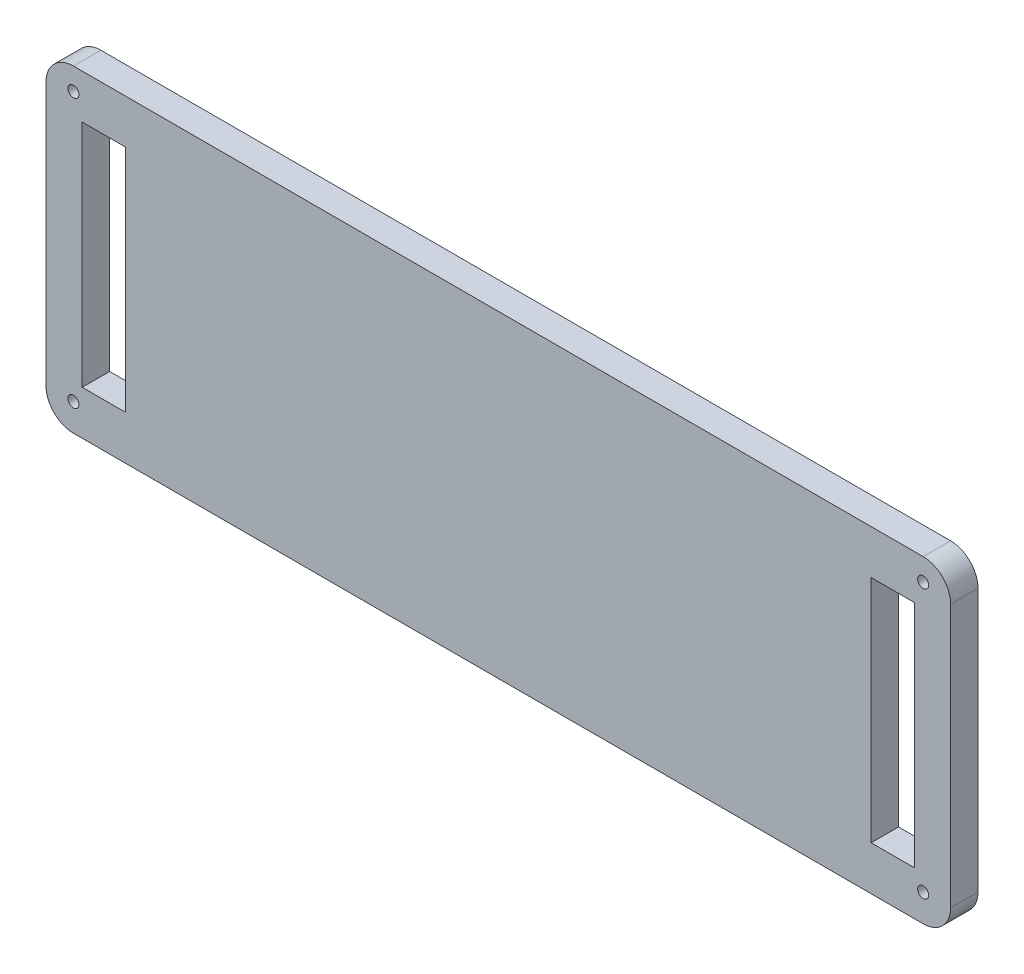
ISO-10303-21;
HEADER;
FILE_DESCRIPTION(('STEP AP214'),'2;1');
FILE_NAME('part.step','',(''),(''),'','','');
FILE_SCHEMA(('AUTOMOTIVE_DESIGN { 1 0 10303 214 1 1 1 1 }'));
ENDSEC;
DATA;
#1=APPLICATION_CONTEXT('core data for automotive mechanical design processes');
#2=APPLICATION_PROTOCOL_DEFINITION('international standard','automotive_design',2000,#1);
#3=PRODUCT_CONTEXT('',#1,'mechanical');
#4=PRODUCT('Part','Part','',(#3));
#5=PRODUCT_RELATED_PRODUCT_CATEGORY('part','',(#4));
#6=PRODUCT_DEFINITION_FORMATION('','',#4);
#7=PRODUCT_DEFINITION_CONTEXT('part definition',#1,'design');
#8=PRODUCT_DEFINITION('design','',#6,#7);
#9=PRODUCT_DEFINITION_SHAPE('','',#8);
#10=(LENGTH_UNIT() NAMED_UNIT(*) SI_UNIT(.MILLI.,.METRE.));
#11=(NAMED_UNIT(*) PLANE_ANGLE_UNIT() SI_UNIT($,.RADIAN.));
#12=(NAMED_UNIT(*) SI_UNIT($,.STERADIAN.) SOLID_ANGLE_UNIT());
#13=UNCERTAINTY_MEASURE_WITH_UNIT(LENGTH_MEASURE(1.E-05),#10,'distance_accuracy_value','');
#14=(GEOMETRIC_REPRESENTATION_CONTEXT(3) GLOBAL_UNCERTAINTY_ASSIGNED_CONTEXT((#13)) GLOBAL_UNIT_ASSIGNED_CONTEXT((#10,
#11,#12)) REPRESENTATION_CONTEXT('',''));
#15=CARTESIAN_POINT('',(0.,0.,0.));
#16=DIRECTION('',(0.,0.,1.));
#17=DIRECTION('',(1.,0.,0.));
#18=AXIS2_PLACEMENT_3D('',#15,#16,#17);
#19=CARTESIAN_POINT('',(107.488593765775,-74.7439939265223,51.7236075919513));
#20=DIRECTION('',(-1.,0.,0.));
#21=DIRECTION('',(0.,0.,1.));
#22=AXIS2_PLACEMENT_3D('',#19,#20,#21);
#23=PLANE('',#22);
#24=DIRECTION('',(0.,1.,0.));
#25=VECTOR('',#24,1.);
#26=CARTESIAN_POINT('',(107.488593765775,-74.7439939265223,41.7236075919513));
#27=LINE('',#26,#25);
#28=CARTESIAN_POINT('',(107.488593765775,-64.7439939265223,41.7236075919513));
#29=VERTEX_POINT('',#28);
#30=CARTESIAN_POINT('',(107.488593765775,31.2560060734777,41.7236075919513));
#31=VERTEX_POINT('',#30);
#32=EDGE_CURVE('E270',#29,#31,#27,.T.);
#33=ORIENTED_EDGE('',*,*,#32,.T.);
#34=DIRECTION('',(0.,0.,-1.));
#35=VECTOR('',#34,1.);
#36=CARTESIAN_POINT('',(107.488593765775,31.2560060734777,51.7236075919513));
#37=LINE('',#36,#35);
#38=CARTESIAN_POINT('',(107.488593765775,31.2560060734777,51.7236075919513));
#39=VERTEX_POINT('',#38);
#40=EDGE_CURVE('E328',#31,#39,#37,.F.);
#41=ORIENTED_EDGE('',*,*,#40,.T.);
#42=DIRECTION('',(0.,1.,0.));
#43=VECTOR('',#42,1.);
#44=CARTESIAN_POINT('',(107.488593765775,-74.7439939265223,51.7236075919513));
#45=LINE('',#44,#43);
#46=CARTESIAN_POINT('',(107.488593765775,-64.7439939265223,51.7236075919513));
#47=VERTEX_POINT('',#46);
#48=EDGE_CURVE('E274',#47,#39,#45,.T.);
#49=ORIENTED_EDGE('',*,*,#48,.F.);
#50=DIRECTION('',(0.,0.,-1.));
#51=VECTOR('',#50,1.);
#52=CARTESIAN_POINT('',(107.488593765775,-64.7439939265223,51.7236075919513));
#53=LINE('',#52,#51);
#54=EDGE_CURVE('E324',#47,#29,#53,.T.);
#55=ORIENTED_EDGE('',*,*,#54,.T.);
#56=EDGE_LOOP('',(#33,#41,#49,#55));
#57=FACE_BOUND('',#56,.T.);
#58=ADVANCED_FACE('F39',(#57),#23,.F.);
#59=CARTESIAN_POINT('',(-222.511406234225,41.2560060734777,51.7236075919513));
#60=DIRECTION('',(0.,-1.,0.));
#61=DIRECTION('',(0.,0.,-1.));
#62=AXIS2_PLACEMENT_3D('',#59,#60,#61);
#63=PLANE('',#62);
#64=DIRECTION('',(-1.,0.,0.));
#65=VECTOR('',#64,1.);
#66=CARTESIAN_POINT('',(-222.511406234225,41.2560060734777,51.7236075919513));
#67=LINE('',#66,#65);
#68=CARTESIAN_POINT('',(97.4885937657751,41.2560060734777,51.7236075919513));
#69=VERTEX_POINT('',#68);
#70=CARTESIAN_POINT('',(-212.511406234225,41.2560060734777,51.7236075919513));
#71=VERTEX_POINT('',#70);
#72=EDGE_CURVE('E278',#69,#71,#67,.T.);
#73=ORIENTED_EDGE('',*,*,#72,.F.);
#74=DIRECTION('',(0.,0.,-1.));
#75=VECTOR('',#74,1.);
#76=CARTESIAN_POINT('',(97.4885937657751,41.2560060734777,51.7236075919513));
#77=LINE('',#76,#75);
#78=CARTESIAN_POINT('',(97.4885937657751,41.2560060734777,41.7236075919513));
#79=VERTEX_POINT('',#78);
#80=EDGE_CURVE('E308',#69,#79,#77,.T.);
#81=ORIENTED_EDGE('',*,*,#80,.T.);
#82=DIRECTION('',(-1.,0.,0.));
#83=VECTOR('',#82,1.);
#84=CARTESIAN_POINT('',(-222.511406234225,41.2560060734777,41.7236075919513));
#85=LINE('',#84,#83);
#86=CARTESIAN_POINT('',(-212.511406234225,41.2560060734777,41.7236075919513));
#87=VERTEX_POINT('',#86);
#88=EDGE_CURVE('E295',#79,#87,#85,.T.);
#89=ORIENTED_EDGE('',*,*,#88,.T.);
#90=DIRECTION('',(0.,0.,-1.));
#91=VECTOR('',#90,1.);
#92=CARTESIAN_POINT('',(-212.511406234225,41.2560060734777,51.7236075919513));
#93=LINE('',#92,#91);
#94=EDGE_CURVE('E291',#87,#71,#93,.F.);
#95=ORIENTED_EDGE('',*,*,#94,.T.);
#96=EDGE_LOOP('',(#73,#81,#89,#95));
#97=FACE_BOUND('',#96,.T.);
#98=ADVANCED_FACE('F386',(#97),#63,.F.);
#99=CARTESIAN_POINT('',(-222.511406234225,-74.7439939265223,51.7236075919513));
#100=DIRECTION('',(1.,0.,0.));
#101=DIRECTION('',(0.,0.,-1.));
#102=AXIS2_PLACEMENT_3D('',#99,#100,#101);
#103=PLANE('',#102);
#104=DIRECTION('',(0.,-1.,0.));
#105=VECTOR('',#104,1.);
#106=CARTESIAN_POINT('',(-222.511406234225,-74.7439939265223,41.7236075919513));
#107=LINE('',#106,#105);
#108=CARTESIAN_POINT('',(-222.511406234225,31.2560060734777,41.7236075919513));
#109=VERTEX_POINT('',#108);
#110=CARTESIAN_POINT('',(-222.511406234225,-64.7439939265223,41.7236075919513));
#111=VERTEX_POINT('',#110);
#112=EDGE_CURVE('E299',#109,#111,#107,.T.);
#113=ORIENTED_EDGE('',*,*,#112,.T.);
#114=DIRECTION('',(0.,0.,-1.));
#115=VECTOR('',#114,1.);
#116=CARTESIAN_POINT('',(-222.511406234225,-64.7439939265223,51.7236075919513));
#117=LINE('',#116,#115);
#118=CARTESIAN_POINT('',(-222.511406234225,-64.7439939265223,51.7236075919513));
#119=VERTEX_POINT('',#118);
#120=EDGE_CURVE('E11',#111,#119,#117,.F.);
#121=ORIENTED_EDGE('',*,*,#120,.T.);
#122=DIRECTION('',(0.,-1.,0.));
#123=VECTOR('',#122,1.);
#124=CARTESIAN_POINT('',(-222.511406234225,-74.7439939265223,51.7236075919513));
#125=LINE('',#124,#123);
#126=CARTESIAN_POINT('',(-222.511406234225,31.2560060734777,51.7236075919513));
#127=VERTEX_POINT('',#126);
#128=EDGE_CURVE('E283',#127,#119,#125,.T.);
#129=ORIENTED_EDGE('',*,*,#128,.F.);
#130=DIRECTION('',(0.,0.,-1.));
#131=VECTOR('',#130,1.);
#132=CARTESIAN_POINT('',(-222.511406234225,31.2560060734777,51.7236075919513));
#133=LINE('',#132,#131);
#134=EDGE_CURVE('E48',#127,#109,#133,.T.);
#135=ORIENTED_EDGE('',*,*,#134,.T.);
#136=EDGE_LOOP('',(#113,#121,#129,#135));
#137=FACE_BOUND('',#136,.T.);
#138=ADVANCED_FACE('F355',(#137),#103,.F.);
#139=CARTESIAN_POINT('',(-222.511406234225,-74.7439939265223,51.7236075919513));
#140=DIRECTION('',(0.,1.,0.));
#141=DIRECTION('',(0.,0.,1.));
#142=AXIS2_PLACEMENT_3D('',#139,#140,#141);
#143=PLANE('',#142);
#144=DIRECTION('',(1.,0.,0.));
#145=VECTOR('',#144,1.);
#146=CARTESIAN_POINT('',(-222.511406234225,-74.7439939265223,41.7236075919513));
#147=LINE('',#146,#145);
#148=CARTESIAN_POINT('',(-212.511406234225,-74.7439939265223,41.7236075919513));
#149=VERTEX_POINT('',#148);
#150=CARTESIAN_POINT('',(97.4885937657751,-74.7439939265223,41.7236075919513));
#151=VERTEX_POINT('',#150);
#152=EDGE_CURVE('E279',#149,#151,#147,.T.);
#153=ORIENTED_EDGE('',*,*,#152,.T.);
#154=DIRECTION('',(0.,0.,-1.));
#155=VECTOR('',#154,1.);
#156=CARTESIAN_POINT('',(97.4885937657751,-74.7439939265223,51.7236075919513));
#157=LINE('',#156,#155);
#158=CARTESIAN_POINT('',(97.4885937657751,-74.7439939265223,51.7236075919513));
#159=VERTEX_POINT('',#158);
#160=EDGE_CURVE('E347',#151,#159,#157,.F.);
#161=ORIENTED_EDGE('',*,*,#160,.T.);
#162=DIRECTION('',(1.,0.,0.));
#163=VECTOR('',#162,1.);
#164=CARTESIAN_POINT('',(-222.511406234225,-74.7439939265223,51.7236075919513));
#165=LINE('',#164,#163);
#166=CARTESIAN_POINT('',(-212.511406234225,-74.7439939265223,51.7236075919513));
#167=VERTEX_POINT('',#166);
#168=EDGE_CURVE('E287',#167,#159,#165,.T.);
#169=ORIENTED_EDGE('',*,*,#168,.F.);
#170=DIRECTION('',(0.,0.,-1.));
#171=VECTOR('',#170,1.);
#172=CARTESIAN_POINT('',(-212.511406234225,-74.7439939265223,51.7236075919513));
#173=LINE('',#172,#171);
#174=EDGE_CURVE('E343',#167,#149,#173,.T.);
#175=ORIENTED_EDGE('',*,*,#174,.T.);
#176=EDGE_LOOP('',(#153,#161,#169,#175));
#177=FACE_BOUND('',#176,.T.);
#178=ADVANCED_FACE('F368',(#177),#143,.F.);
#179=CARTESIAN_POINT('',(-57.511406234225,-16.7439939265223,51.7236075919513));
#180=DIRECTION('',(0.,0.,-1.));
#181=DIRECTION('',(-1.,0.,0.));
#182=AXIS2_PLACEMENT_3D('',#179,#180,#181);
#183=PLANE('',#182);
#184=DIRECTION('',(-1.,0.,0.));
#185=VECTOR('',#184,1.);
#186=CARTESIAN_POINT('',(94.2885937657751,25.1560060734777,51.7236075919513));
#187=LINE('',#186,#185);
#188=CARTESIAN_POINT('',(94.2885937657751,25.1560060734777,51.7236075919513));
#189=VERTEX_POINT('',#188);
#190=CARTESIAN_POINT('',(78.4885937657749,25.1560060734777,51.7236075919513));
#191=VERTEX_POINT('',#190);
#192=EDGE_CURVE('E184',#189,#191,#187,.T.);
#193=ORIENTED_EDGE('',*,*,#192,.F.);
#194=DIRECTION('',(0.,1.,0.));
#195=VECTOR('',#194,1.);
#196=CARTESIAN_POINT('',(94.2885937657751,-58.6439939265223,51.7236075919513));
#197=LINE('',#196,#195);
#198=CARTESIAN_POINT('',(94.2885937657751,-58.6439939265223,51.7236075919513));
#199=VERTEX_POINT('',#198);
#200=EDGE_CURVE('E55',#199,#189,#197,.T.);
#201=ORIENTED_EDGE('',*,*,#200,.F.);
#202=DIRECTION('',(-1.,0.,0.));
#203=VECTOR('',#202,1.);
#204=CARTESIAN_POINT('',(94.2885937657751,-58.6439939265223,51.7236075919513));
#205=LINE('',#204,#203);
#206=CARTESIAN_POINT('',(78.4885937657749,-58.6439939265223,51.7236075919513));
#207=VERTEX_POINT('',#206);
#208=EDGE_CURVE('E171',#199,#207,#205,.T.);
#209=ORIENTED_EDGE('',*,*,#208,.T.);
#210=DIRECTION('',(0.,1.,0.));
#211=VECTOR('',#210,1.);
#212=CARTESIAN_POINT('',(78.4885937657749,-58.6439939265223,51.7236075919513));
#213=LINE('',#212,#211);
#214=EDGE_CURVE('E175',#207,#191,#213,.T.);
#215=ORIENTED_EDGE('',*,*,#214,.T.);
#216=EDGE_LOOP('',(#193,#201,#209,#215));
#217=FACE_BOUND('',#216,.T.);
#218=DIRECTION('',(0.,1.,0.));
#219=VECTOR('',#218,1.);
#220=CARTESIAN_POINT('',(-193.511406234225,-58.6439939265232,51.7236075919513));
#221=LINE('',#220,#219);
#222=CARTESIAN_POINT('',(-193.511406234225,-58.6439939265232,51.7236075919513));
#223=VERTEX_POINT('',#222);
#224=CARTESIAN_POINT('',(-193.511406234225,25.1560060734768,51.7236075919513));
#225=VERTEX_POINT('',#224);
#226=EDGE_CURVE('E218',#223,#225,#221,.T.);
#227=ORIENTED_EDGE('',*,*,#226,.F.);
#228=DIRECTION('',(1.,0.,0.));
#229=VECTOR('',#228,1.);
#230=CARTESIAN_POINT('',(-209.311406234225,-58.6439939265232,51.7236075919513));
#231=LINE('',#230,#229);
#232=CARTESIAN_POINT('',(-209.311406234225,-58.6439939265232,51.7236075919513));
#233=VERTEX_POINT('',#232);
#234=EDGE_CURVE('E193',#233,#223,#231,.T.);
#235=ORIENTED_EDGE('',*,*,#234,.F.);
#236=DIRECTION('',(0.,1.,0.));
#237=VECTOR('',#236,1.);
#238=CARTESIAN_POINT('',(-209.311406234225,-58.6439939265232,51.7236075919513));
#239=LINE('',#238,#237);
#240=CARTESIAN_POINT('',(-209.311406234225,25.1560060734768,51.7236075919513));
#241=VERTEX_POINT('',#240);
#242=EDGE_CURVE('E204',#233,#241,#239,.T.);
#243=ORIENTED_EDGE('',*,*,#242,.T.);
#244=DIRECTION('',(1.,0.,0.));
#245=VECTOR('',#244,1.);
#246=CARTESIAN_POINT('',(-209.311406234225,25.1560060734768,51.7236075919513));
#247=LINE('',#246,#245);
#248=EDGE_CURVE('E222',#241,#225,#247,.T.);
#249=ORIENTED_EDGE('',*,*,#248,.T.);
#250=EDGE_LOOP('',(#227,#235,#243,#249));
#251=FACE_BOUND('',#250,.T.);
#252=CARTESIAN_POINT('',(-212.511406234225,33.2060060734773,51.7236075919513));
#253=DIRECTION('',(0.,0.,1.));
#254=DIRECTION('',(1.,0.,0.));
#255=AXIS2_PLACEMENT_3D('',#252,#253,#254);
#256=CIRCLE('',#255,2.00102409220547);
#257=CARTESIAN_POINT('',(-210.510382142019,33.2060060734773,51.7236075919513));
#258=VERTEX_POINT('',#257);
#259=EDGE_CURVE('E255',#258,#258,#256,.T.);
#260=ORIENTED_EDGE('',*,*,#259,.F.);
#261=EDGE_LOOP('',(#260));
#262=FACE_BOUND('',#261,.T.);
#263=CARTESIAN_POINT('',(97.4885937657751,-64.7439939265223,51.7236075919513));
#264=DIRECTION('',(0.,0.,1.));
#265=DIRECTION('',(1.,0.,0.));
#266=AXIS2_PLACEMENT_3D('',#263,#264,#265);
#267=CIRCLE('',#266,2.);
#268=CARTESIAN_POINT('',(99.4885937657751,-64.7439939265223,51.7236075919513));
#269=VERTEX_POINT('',#268);
#270=EDGE_CURVE('E246',#269,#269,#267,.T.);
#271=ORIENTED_EDGE('',*,*,#270,.F.);
#272=EDGE_LOOP('',(#271));
#273=FACE_BOUND('',#272,.T.);
#274=CARTESIAN_POINT('',(97.4885937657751,33.2060060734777,51.7236075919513));
#275=DIRECTION('',(0.,0.,1.));
#276=DIRECTION('',(1.,0.,0.));
#277=AXIS2_PLACEMENT_3D('',#274,#275,#276);
#278=CIRCLE('',#277,2.);
#279=CARTESIAN_POINT('',(99.4885937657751,33.2060060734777,51.7236075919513));
#280=VERTEX_POINT('',#279);
#281=EDGE_CURVE('E232',#280,#280,#278,.T.);
#282=ORIENTED_EDGE('',*,*,#281,.F.);
#283=EDGE_LOOP('',(#282));
#284=FACE_BOUND('',#283,.T.);
#285=CARTESIAN_POINT('',(-212.511406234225,-64.7439939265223,51.7236075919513));
#286=DIRECTION('',(0.,0.,1.));
#287=DIRECTION('',(1.,0.,0.));
#288=AXIS2_PLACEMENT_3D('',#285,#286,#287);
#289=CIRCLE('',#288,2.);
#290=CARTESIAN_POINT('',(-210.511406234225,-64.7439939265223,51.7236075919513));
#291=VERTEX_POINT('',#290);
#292=EDGE_CURVE('E254',#291,#291,#289,.T.);
#293=ORIENTED_EDGE('',*,*,#292,.F.);
#294=EDGE_LOOP('',(#293));
#295=FACE_BOUND('',#294,.T.);
#296=ORIENTED_EDGE('',*,*,#48,.T.);
#297=CARTESIAN_POINT('',(97.4885937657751,31.2560060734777,51.7236075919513));
#298=DIRECTION('',(0.,0.,-1.));
#299=DIRECTION('',(-1.,0.,0.));
#300=AXIS2_PLACEMENT_3D('',#297,#298,#299);
#301=CIRCLE('',#300,10.);
#302=EDGE_CURVE('E340',#39,#69,#301,.F.);
#303=ORIENTED_EDGE('',*,*,#302,.T.);
#304=ORIENTED_EDGE('',*,*,#72,.T.);
#305=CARTESIAN_POINT('',(-212.511406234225,31.2560060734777,51.7236075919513));
#306=DIRECTION('',(0.,0.,-1.));
#307=DIRECTION('',(-1.,0.,0.));
#308=AXIS2_PLACEMENT_3D('',#305,#306,#307);
#309=CIRCLE('',#308,10.);
#310=EDGE_CURVE('E331',#71,#127,#309,.F.);
#311=ORIENTED_EDGE('',*,*,#310,.T.);
#312=ORIENTED_EDGE('',*,*,#128,.T.);
#313=CARTESIAN_POINT('',(-212.511406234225,-64.7439939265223,51.7236075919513));
#314=DIRECTION('',(0.,0.,-1.));
#315=DIRECTION('',(-1.,0.,0.));
#316=AXIS2_PLACEMENT_3D('',#313,#314,#315);
#317=CIRCLE('',#316,10.);
#318=EDGE_CURVE('E334',#119,#167,#317,.F.);
#319=ORIENTED_EDGE('',*,*,#318,.T.);
#320=ORIENTED_EDGE('',*,*,#168,.T.);
#321=CARTESIAN_POINT('',(97.4885937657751,-64.7439939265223,51.7236075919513));
#322=DIRECTION('',(0.,0.,-1.));
#323=DIRECTION('',(-1.,0.,0.));
#324=AXIS2_PLACEMENT_3D('',#321,#322,#323);
#325=CIRCLE('',#324,10.);
#326=EDGE_CURVE('E337',#159,#47,#325,.F.);
#327=ORIENTED_EDGE('',*,*,#326,.T.);
#328=EDGE_LOOP('',(#296,#303,#304,#311,#312,#319,#320,#327));
#329=FACE_BOUND('',#328,.T.);
#330=ADVANCED_FACE('F372',(#217,#251,#262,#273,#284,#295,#329),#183,.F.);
#331=CARTESIAN_POINT('',(-57.511406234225,-16.7439939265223,41.7236075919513));
#332=DIRECTION('',(0.,0.,-1.));
#333=DIRECTION('',(-1.,0.,0.));
#334=AXIS2_PLACEMENT_3D('',#331,#332,#333);
#335=PLANE('',#334);
#336=DIRECTION('',(0.,1.,0.));
#337=VECTOR('',#336,1.);
#338=CARTESIAN_POINT('',(94.2885937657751,-58.6439939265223,41.7236075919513));
#339=LINE('',#338,#337);
#340=CARTESIAN_POINT('',(94.2885937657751,-58.6439939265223,41.7236075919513));
#341=VERTEX_POINT('',#340);
#342=CARTESIAN_POINT('',(94.2885937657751,25.1560060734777,41.7236075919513));
#343=VERTEX_POINT('',#342);
#344=EDGE_CURVE('E154',#341,#343,#339,.T.);
#345=ORIENTED_EDGE('',*,*,#344,.T.);
#346=DIRECTION('',(-1.,0.,0.));
#347=VECTOR('',#346,1.);
#348=CARTESIAN_POINT('',(94.2885937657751,25.1560060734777,41.7236075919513));
#349=LINE('',#348,#347);
#350=CARTESIAN_POINT('',(78.4885937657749,25.1560060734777,41.7236075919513));
#351=VERTEX_POINT('',#350);
#352=EDGE_CURVE('E161',#343,#351,#349,.T.);
#353=ORIENTED_EDGE('',*,*,#352,.T.);
#354=DIRECTION('',(0.,1.,0.));
#355=VECTOR('',#354,1.);
#356=CARTESIAN_POINT('',(78.4885937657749,-58.6439939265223,41.7236075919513));
#357=LINE('',#356,#355);
#358=CARTESIAN_POINT('',(78.4885937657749,-58.6439939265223,41.7236075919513));
#359=VERTEX_POINT('',#358);
#360=EDGE_CURVE('E166',#359,#351,#357,.T.);
#361=ORIENTED_EDGE('',*,*,#360,.F.);
#362=DIRECTION('',(-1.,0.,0.));
#363=VECTOR('',#362,1.);
#364=CARTESIAN_POINT('',(94.2885937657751,-58.6439939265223,41.7236075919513));
#365=LINE('',#364,#363);
#366=EDGE_CURVE('E158',#341,#359,#365,.T.);
#367=ORIENTED_EDGE('',*,*,#366,.F.);
#368=EDGE_LOOP('',(#345,#353,#361,#367));
#369=FACE_BOUND('',#368,.T.);
#370=DIRECTION('',(1.,0.,0.));
#371=VECTOR('',#370,1.);
#372=CARTESIAN_POINT('',(-209.311406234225,-58.6439939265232,41.7236075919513));
#373=LINE('',#372,#371);
#374=CARTESIAN_POINT('',(-209.311406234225,-58.6439939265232,41.7236075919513));
#375=VERTEX_POINT('',#374);
#376=CARTESIAN_POINT('',(-193.511406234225,-58.6439939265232,41.7236075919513));
#377=VERTEX_POINT('',#376);
#378=EDGE_CURVE('E199',#375,#377,#373,.T.);
#379=ORIENTED_EDGE('',*,*,#378,.T.);
#380=DIRECTION('',(0.,1.,0.));
#381=VECTOR('',#380,1.);
#382=CARTESIAN_POINT('',(-193.511406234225,-58.6439939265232,41.7236075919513));
#383=LINE('',#382,#381);
#384=CARTESIAN_POINT('',(-193.511406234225,25.1560060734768,41.7236075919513));
#385=VERTEX_POINT('',#384);
#386=EDGE_CURVE('E203',#377,#385,#383,.T.);
#387=ORIENTED_EDGE('',*,*,#386,.T.);
#388=DIRECTION('',(1.,0.,0.));
#389=VECTOR('',#388,1.);
#390=CARTESIAN_POINT('',(-209.311406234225,25.1560060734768,41.7236075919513));
#391=LINE('',#390,#389);
#392=CARTESIAN_POINT('',(-209.311406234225,25.1560060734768,41.7236075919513));
#393=VERTEX_POINT('',#392);
#394=EDGE_CURVE('E208',#393,#385,#391,.T.);
#395=ORIENTED_EDGE('',*,*,#394,.F.);
#396=DIRECTION('',(0.,1.,0.));
#397=VECTOR('',#396,1.);
#398=CARTESIAN_POINT('',(-209.311406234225,-58.6439939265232,41.7236075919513));
#399=LINE('',#398,#397);
#400=EDGE_CURVE('E212',#375,#393,#399,.T.);
#401=ORIENTED_EDGE('',*,*,#400,.F.);
#402=EDGE_LOOP('',(#379,#387,#395,#401));
#403=FACE_BOUND('',#402,.T.);
#404=CARTESIAN_POINT('',(-212.511406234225,33.2060060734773,41.7236075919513));
#405=DIRECTION('',(0.,0.,1.));
#406=DIRECTION('',(1.,0.,0.));
#407=AXIS2_PLACEMENT_3D('',#404,#405,#406);
#408=CIRCLE('',#407,2.00102409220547);
#409=CARTESIAN_POINT('',(-210.510382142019,33.2060060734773,41.7236075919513));
#410=VERTEX_POINT('',#409);
#411=EDGE_CURVE('E250',#410,#410,#408,.T.);
#412=ORIENTED_EDGE('',*,*,#411,.T.);
#413=EDGE_LOOP('',(#412));
#414=FACE_BOUND('',#413,.T.);
#415=CARTESIAN_POINT('',(97.4885937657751,-64.7439939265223,41.7236075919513));
#416=DIRECTION('',(0.,0.,1.));
#417=DIRECTION('',(1.,0.,0.));
#418=AXIS2_PLACEMENT_3D('',#415,#416,#417);
#419=CIRCLE('',#418,2.);
#420=CARTESIAN_POINT('',(99.4885937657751,-64.7439939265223,41.7236075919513));
#421=VERTEX_POINT('',#420);
#422=EDGE_CURVE('E259',#421,#421,#419,.T.);
#423=ORIENTED_EDGE('',*,*,#422,.T.);
#424=EDGE_LOOP('',(#423));
#425=FACE_BOUND('',#424,.T.);
#426=CARTESIAN_POINT('',(97.4885937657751,33.2060060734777,41.7236075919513));
#427=DIRECTION('',(0.,0.,1.));
#428=DIRECTION('',(1.,0.,0.));
#429=AXIS2_PLACEMENT_3D('',#426,#427,#428);
#430=CIRCLE('',#429,2.);
#431=CARTESIAN_POINT('',(99.4885937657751,33.2060060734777,41.7236075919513));
#432=VERTEX_POINT('',#431);
#433=EDGE_CURVE('E242',#432,#432,#430,.T.);
#434=ORIENTED_EDGE('',*,*,#433,.T.);
#435=EDGE_LOOP('',(#434));
#436=FACE_BOUND('',#435,.T.);
#437=CARTESIAN_POINT('',(-212.511406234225,-64.7439939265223,41.7236075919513));
#438=DIRECTION('',(0.,0.,1.));
#439=DIRECTION('',(1.,0.,0.));
#440=AXIS2_PLACEMENT_3D('',#437,#438,#439);
#441=CIRCLE('',#440,2.);
#442=CARTESIAN_POINT('',(-210.511406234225,-64.7439939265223,41.7236075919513));
#443=VERTEX_POINT('',#442);
#444=EDGE_CURVE('E266',#443,#443,#441,.T.);
#445=ORIENTED_EDGE('',*,*,#444,.T.);
#446=EDGE_LOOP('',(#445));
#447=FACE_BOUND('',#446,.T.);
#448=ORIENTED_EDGE('',*,*,#88,.F.);
#449=CARTESIAN_POINT('',(97.4885937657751,31.2560060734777,41.7236075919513));
#450=DIRECTION('',(0.,0.,-1.));
#451=DIRECTION('',(-1.,0.,0.));
#452=AXIS2_PLACEMENT_3D('',#449,#450,#451);
#453=CIRCLE('',#452,10.);
#454=EDGE_CURVE('E321',#79,#31,#453,.T.);
#455=ORIENTED_EDGE('',*,*,#454,.T.);
#456=ORIENTED_EDGE('',*,*,#32,.F.);
#457=CARTESIAN_POINT('',(97.4885937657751,-64.7439939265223,41.7236075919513));
#458=DIRECTION('',(0.,0.,-1.));
#459=DIRECTION('',(-1.,0.,0.));
#460=AXIS2_PLACEMENT_3D('',#457,#458,#459);
#461=CIRCLE('',#460,10.);
#462=EDGE_CURVE('E318',#29,#151,#461,.T.);
#463=ORIENTED_EDGE('',*,*,#462,.T.);
#464=ORIENTED_EDGE('',*,*,#152,.F.);
#465=CARTESIAN_POINT('',(-212.511406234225,-64.7439939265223,41.7236075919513));
#466=DIRECTION('',(0.,0.,-1.));
#467=DIRECTION('',(-1.,0.,0.));
#468=AXIS2_PLACEMENT_3D('',#465,#466,#467);
#469=CIRCLE('',#468,10.);
#470=EDGE_CURVE('E315',#149,#111,#469,.T.);
#471=ORIENTED_EDGE('',*,*,#470,.T.);
#472=ORIENTED_EDGE('',*,*,#112,.F.);
#473=CARTESIAN_POINT('',(-212.511406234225,31.2560060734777,41.7236075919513));
#474=DIRECTION('',(0.,0.,-1.));
#475=DIRECTION('',(-1.,0.,0.));
#476=AXIS2_PLACEMENT_3D('',#473,#474,#475);
#477=CIRCLE('',#476,10.);
#478=EDGE_CURVE('E312',#109,#87,#477,.T.);
#479=ORIENTED_EDGE('',*,*,#478,.T.);
#480=EDGE_LOOP('',(#448,#455,#456,#463,#464,#471,#472,#479));
#481=FACE_BOUND('',#480,.T.);
#482=ADVANCED_FACE('F168',(#369,#403,#414,#425,#436,#447,#481),#335,.T.);
#483=CARTESIAN_POINT('',(97.4885937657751,31.2560060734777,51.7236075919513));
#484=DIRECTION('',(0.,0.,-1.));
#485=DIRECTION('',(-1.,0.,0.));
#486=AXIS2_PLACEMENT_3D('',#483,#484,#485);
#487=CYLINDRICAL_SURFACE('',#486,10.);
#488=ORIENTED_EDGE('',*,*,#302,.F.);
#489=ORIENTED_EDGE('',*,*,#40,.F.);
#490=ORIENTED_EDGE('',*,*,#454,.F.);
#491=ORIENTED_EDGE('',*,*,#80,.F.);
#492=EDGE_LOOP('',(#488,#489,#490,#491));
#493=FACE_BOUND('',#492,.T.);
#494=ADVANCED_FACE('F383',(#493),#487,.T.);
#495=CARTESIAN_POINT('',(97.4885937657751,-64.7439939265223,51.7236075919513));
#496=DIRECTION('',(0.,0.,-1.));
#497=DIRECTION('',(-1.,0.,0.));
#498=AXIS2_PLACEMENT_3D('',#495,#496,#497);
#499=CYLINDRICAL_SURFACE('',#498,10.);
#500=ORIENTED_EDGE('',*,*,#326,.F.);
#501=ORIENTED_EDGE('',*,*,#160,.F.);
#502=ORIENTED_EDGE('',*,*,#462,.F.);
#503=ORIENTED_EDGE('',*,*,#54,.F.);
#504=EDGE_LOOP('',(#500,#501,#502,#503));
#505=FACE_BOUND('',#504,.T.);
#506=ADVANCED_FACE('F376',(#505),#499,.T.);
#507=CARTESIAN_POINT('',(-212.511406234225,-64.7439939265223,51.7236075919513));
#508=DIRECTION('',(0.,0.,-1.));
#509=DIRECTION('',(-1.,0.,0.));
#510=AXIS2_PLACEMENT_3D('',#507,#508,#509);
#511=CYLINDRICAL_SURFACE('',#510,10.);
#512=ORIENTED_EDGE('',*,*,#318,.F.);
#513=ORIENTED_EDGE('',*,*,#120,.F.);
#514=ORIENTED_EDGE('',*,*,#470,.F.);
#515=ORIENTED_EDGE('',*,*,#174,.F.);
#516=EDGE_LOOP('',(#512,#513,#514,#515));
#517=FACE_BOUND('',#516,.T.);
#518=ADVANCED_FACE('F365',(#517),#511,.T.);
#519=CARTESIAN_POINT('',(-212.511406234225,31.2560060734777,51.7236075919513));
#520=DIRECTION('',(0.,0.,-1.));
#521=DIRECTION('',(-1.,0.,0.));
#522=AXIS2_PLACEMENT_3D('',#519,#520,#521);
#523=CYLINDRICAL_SURFACE('',#522,10.);
#524=ORIENTED_EDGE('',*,*,#310,.F.);
#525=ORIENTED_EDGE('',*,*,#94,.F.);
#526=ORIENTED_EDGE('',*,*,#478,.F.);
#527=ORIENTED_EDGE('',*,*,#134,.F.);
#528=EDGE_LOOP('',(#524,#525,#526,#527));
#529=FACE_BOUND('',#528,.T.);
#530=ADVANCED_FACE('F41',(#529),#523,.T.);
#531=CARTESIAN_POINT('',(-212.511406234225,-64.7439939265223,41.7236075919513));
#532=DIRECTION('',(0.,0.,1.));
#533=DIRECTION('',(1.,0.,0.));
#534=AXIS2_PLACEMENT_3D('',#531,#532,#533);
#535=CYLINDRICAL_SURFACE('',#534,2.);
#536=ORIENTED_EDGE('',*,*,#444,.F.);
#537=EDGE_LOOP('',(#536));
#538=FACE_BOUND('',#537,.T.);
#539=ORIENTED_EDGE('',*,*,#292,.T.);
#540=EDGE_LOOP('',(#539));
#541=FACE_BOUND('',#540,.T.);
#542=ADVANCED_FACE('F389',(#538,#541),#535,.F.);
#543=CARTESIAN_POINT('',(97.4885937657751,33.2060060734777,41.7236075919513));
#544=DIRECTION('',(0.,0.,1.));
#545=DIRECTION('',(1.,0.,0.));
#546=AXIS2_PLACEMENT_3D('',#543,#544,#545);
#547=CYLINDRICAL_SURFACE('',#546,2.);
#548=ORIENTED_EDGE('',*,*,#433,.F.);
#549=EDGE_LOOP('',(#548));
#550=FACE_BOUND('',#549,.T.);
#551=ORIENTED_EDGE('',*,*,#281,.T.);
#552=EDGE_LOOP('',(#551));
#553=FACE_BOUND('',#552,.T.);
#554=ADVANCED_FACE('F394',(#550,#553),#547,.F.);
#555=CARTESIAN_POINT('',(97.4885937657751,-64.7439939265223,41.7236075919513));
#556=DIRECTION('',(0.,0.,1.));
#557=DIRECTION('',(1.,0.,0.));
#558=AXIS2_PLACEMENT_3D('',#555,#556,#557);
#559=CYLINDRICAL_SURFACE('',#558,2.);
#560=ORIENTED_EDGE('',*,*,#422,.F.);
#561=EDGE_LOOP('',(#560));
#562=FACE_BOUND('',#561,.T.);
#563=ORIENTED_EDGE('',*,*,#270,.T.);
#564=EDGE_LOOP('',(#563));
#565=FACE_BOUND('',#564,.T.);
#566=ADVANCED_FACE('F436',(#562,#565),#559,.F.);
#567=CARTESIAN_POINT('',(-212.511406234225,33.2060060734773,41.7236075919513));
#568=DIRECTION('',(0.,0.,1.));
#569=DIRECTION('',(1.,0.,0.));
#570=AXIS2_PLACEMENT_3D('',#567,#568,#569);
#571=CYLINDRICAL_SURFACE('',#570,2.00102409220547);
#572=ORIENTED_EDGE('',*,*,#411,.F.);
#573=EDGE_LOOP('',(#572));
#574=FACE_BOUND('',#573,.T.);
#575=ORIENTED_EDGE('',*,*,#259,.T.);
#576=EDGE_LOOP('',(#575));
#577=FACE_BOUND('',#576,.T.);
#578=ADVANCED_FACE('F446',(#574,#577),#571,.F.);
#579=CARTESIAN_POINT('',(-209.311406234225,-58.6439939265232,41.7236075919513));
#580=DIRECTION('',(0.,-1.,0.));
#581=DIRECTION('',(0.,0.,-1.));
#582=AXIS2_PLACEMENT_3D('',#579,#580,#581);
#583=PLANE('',#582);
#584=ORIENTED_EDGE('',*,*,#234,.T.);
#585=DIRECTION('',(0.,0.,1.));
#586=VECTOR('',#585,1.);
#587=CARTESIAN_POINT('',(-193.511406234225,-58.6439939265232,41.7236075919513));
#588=LINE('',#587,#586);
#589=EDGE_CURVE('E215',#377,#223,#588,.T.);
#590=ORIENTED_EDGE('',*,*,#589,.F.);
#591=ORIENTED_EDGE('',*,*,#378,.F.);
#592=DIRECTION('',(0.,0.,1.));
#593=VECTOR('',#592,1.);
#594=CARTESIAN_POINT('',(-209.311406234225,-58.6439939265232,41.7236075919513));
#595=LINE('',#594,#593);
#596=EDGE_CURVE('E229',#375,#233,#595,.T.);
#597=ORIENTED_EDGE('',*,*,#596,.T.);
#598=EDGE_LOOP('',(#584,#590,#591,#597));
#599=FACE_BOUND('',#598,.T.);
#600=ADVANCED_FACE('F456',(#599),#583,.F.);
#601=CARTESIAN_POINT('',(-209.311406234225,-58.6439939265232,41.7236075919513));
#602=DIRECTION('',(1.,0.,0.));
#603=DIRECTION('',(0.,0.,-1.));
#604=AXIS2_PLACEMENT_3D('',#601,#602,#603);
#605=PLANE('',#604);
#606=ORIENTED_EDGE('',*,*,#242,.F.);
#607=ORIENTED_EDGE('',*,*,#596,.F.);
#608=ORIENTED_EDGE('',*,*,#400,.T.);
#609=DIRECTION('',(0.,0.,1.));
#610=VECTOR('',#609,1.);
#611=CARTESIAN_POINT('',(-209.311406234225,25.1560060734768,41.7236075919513));
#612=LINE('',#611,#610);
#613=EDGE_CURVE('E233',#393,#241,#612,.T.);
#614=ORIENTED_EDGE('',*,*,#613,.T.);
#615=EDGE_LOOP('',(#606,#607,#608,#614));
#616=FACE_BOUND('',#615,.T.);
#617=ADVANCED_FACE('F467',(#616),#605,.T.);
#618=CARTESIAN_POINT('',(-209.311406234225,25.1560060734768,41.7236075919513));
#619=DIRECTION('',(0.,-1.,0.));
#620=DIRECTION('',(0.,0.,-1.));
#621=AXIS2_PLACEMENT_3D('',#618,#619,#620);
#622=PLANE('',#621);
#623=ORIENTED_EDGE('',*,*,#248,.F.);
#624=ORIENTED_EDGE('',*,*,#613,.F.);
#625=ORIENTED_EDGE('',*,*,#394,.T.);
#626=DIRECTION('',(0.,0.,1.));
#627=VECTOR('',#626,1.);
#628=CARTESIAN_POINT('',(-193.511406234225,25.1560060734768,41.7236075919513));
#629=LINE('',#628,#627);
#630=EDGE_CURVE('E236',#385,#225,#629,.T.);
#631=ORIENTED_EDGE('',*,*,#630,.T.);
#632=EDGE_LOOP('',(#623,#624,#625,#631));
#633=FACE_BOUND('',#632,.T.);
#634=ADVANCED_FACE('F478',(#633),#622,.T.);
#635=CARTESIAN_POINT('',(-193.511406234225,-58.6439939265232,41.7236075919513));
#636=DIRECTION('',(1.,0.,0.));
#637=DIRECTION('',(0.,0.,-1.));
#638=AXIS2_PLACEMENT_3D('',#635,#636,#637);
#639=PLANE('',#638);
#640=ORIENTED_EDGE('',*,*,#226,.T.);
#641=ORIENTED_EDGE('',*,*,#630,.F.);
#642=ORIENTED_EDGE('',*,*,#386,.F.);
#643=ORIENTED_EDGE('',*,*,#589,.T.);
#644=EDGE_LOOP('',(#640,#641,#642,#643));
#645=FACE_BOUND('',#644,.T.);
#646=ADVANCED_FACE('F488',(#645),#639,.F.);
#647=CARTESIAN_POINT('',(94.2885937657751,-58.6439939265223,41.7236075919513));
#648=DIRECTION('',(1.,0.,0.));
#649=DIRECTION('',(0.,0.,-1.));
#650=AXIS2_PLACEMENT_3D('',#647,#648,#649);
#651=PLANE('',#650);
#652=ORIENTED_EDGE('',*,*,#200,.T.);
#653=DIRECTION('',(0.,0.,1.));
#654=VECTOR('',#653,1.);
#655=CARTESIAN_POINT('',(94.2885937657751,25.1560060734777,41.7236075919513));
#656=LINE('',#655,#654);
#657=EDGE_CURVE('E151',#343,#189,#656,.T.);
#658=ORIENTED_EDGE('',*,*,#657,.F.);
#659=ORIENTED_EDGE('',*,*,#344,.F.);
#660=DIRECTION('',(0.,0.,1.));
#661=VECTOR('',#660,1.);
#662=CARTESIAN_POINT('',(94.2885937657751,-58.6439939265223,41.7236075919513));
#663=LINE('',#662,#661);
#664=EDGE_CURVE('E190',#341,#199,#663,.T.);
#665=ORIENTED_EDGE('',*,*,#664,.T.);
#666=EDGE_LOOP('',(#652,#658,#659,#665));
#667=FACE_BOUND('',#666,.T.);
#668=ADVANCED_FACE('F152',(#667),#651,.F.);
#669=CARTESIAN_POINT('',(94.2885937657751,-58.6439939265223,41.7236075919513));
#670=DIRECTION('',(0.,1.,0.));
#671=DIRECTION('',(0.,0.,1.));
#672=AXIS2_PLACEMENT_3D('',#669,#670,#671);
#673=PLANE('',#672);
#674=ORIENTED_EDGE('',*,*,#208,.F.);
#675=ORIENTED_EDGE('',*,*,#664,.F.);
#676=ORIENTED_EDGE('',*,*,#366,.T.);
#677=DIRECTION('',(0.,0.,1.));
#678=VECTOR('',#677,1.);
#679=CARTESIAN_POINT('',(78.4885937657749,-58.6439939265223,41.7236075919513));
#680=LINE('',#679,#678);
#681=EDGE_CURVE('E194',#359,#207,#680,.T.);
#682=ORIENTED_EDGE('',*,*,#681,.T.);
#683=EDGE_LOOP('',(#674,#675,#676,#682));
#684=FACE_BOUND('',#683,.T.);
#685=ADVANCED_FACE('F524',(#684),#673,.T.);
#686=CARTESIAN_POINT('',(78.4885937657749,-58.6439939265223,41.7236075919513));
#687=DIRECTION('',(1.,0.,0.));
#688=DIRECTION('',(0.,0.,-1.));
#689=AXIS2_PLACEMENT_3D('',#686,#687,#688);
#690=PLANE('',#689);
#691=ORIENTED_EDGE('',*,*,#214,.F.);
#692=ORIENTED_EDGE('',*,*,#681,.F.);
#693=ORIENTED_EDGE('',*,*,#360,.T.);
#694=DIRECTION('',(0.,0.,1.));
#695=VECTOR('',#694,1.);
#696=CARTESIAN_POINT('',(78.4885937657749,25.1560060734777,41.7236075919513));
#697=LINE('',#696,#695);
#698=EDGE_CURVE('E63',#351,#191,#697,.T.);
#699=ORIENTED_EDGE('',*,*,#698,.T.);
#700=EDGE_LOOP('',(#691,#692,#693,#699));
#701=FACE_BOUND('',#700,.T.);
#702=ADVANCED_FACE('F533',(#701),#690,.T.);
#703=CARTESIAN_POINT('',(94.2885937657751,25.1560060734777,41.7236075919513));
#704=DIRECTION('',(0.,1.,0.));
#705=DIRECTION('',(0.,0.,1.));
#706=AXIS2_PLACEMENT_3D('',#703,#704,#705);
#707=PLANE('',#706);
#708=ORIENTED_EDGE('',*,*,#192,.T.);
#709=ORIENTED_EDGE('',*,*,#698,.F.);
#710=ORIENTED_EDGE('',*,*,#352,.F.);
#711=ORIENTED_EDGE('',*,*,#657,.T.);
#712=EDGE_LOOP('',(#708,#709,#710,#711));
#713=FACE_BOUND('',#712,.T.);
#714=ADVANCED_FACE('F162',(#713),#707,.F.);
#715=CLOSED_SHELL('',(#58,#98,#138,#178,#330,#482,#494,#506,#518,#530,#542,#554,#566,#578,#600,
#617,#634,#646,#668,#685,#702,#714));
#716=MANIFOLD_SOLID_BREP('B2',#715);
#717=ADVANCED_BREP_SHAPE_REPRESENTATION('',(#18,#716),#14);
#718=SHAPE_DEFINITION_REPRESENTATION(#9,#717);
ENDSEC;
END-ISO-10303-21;
